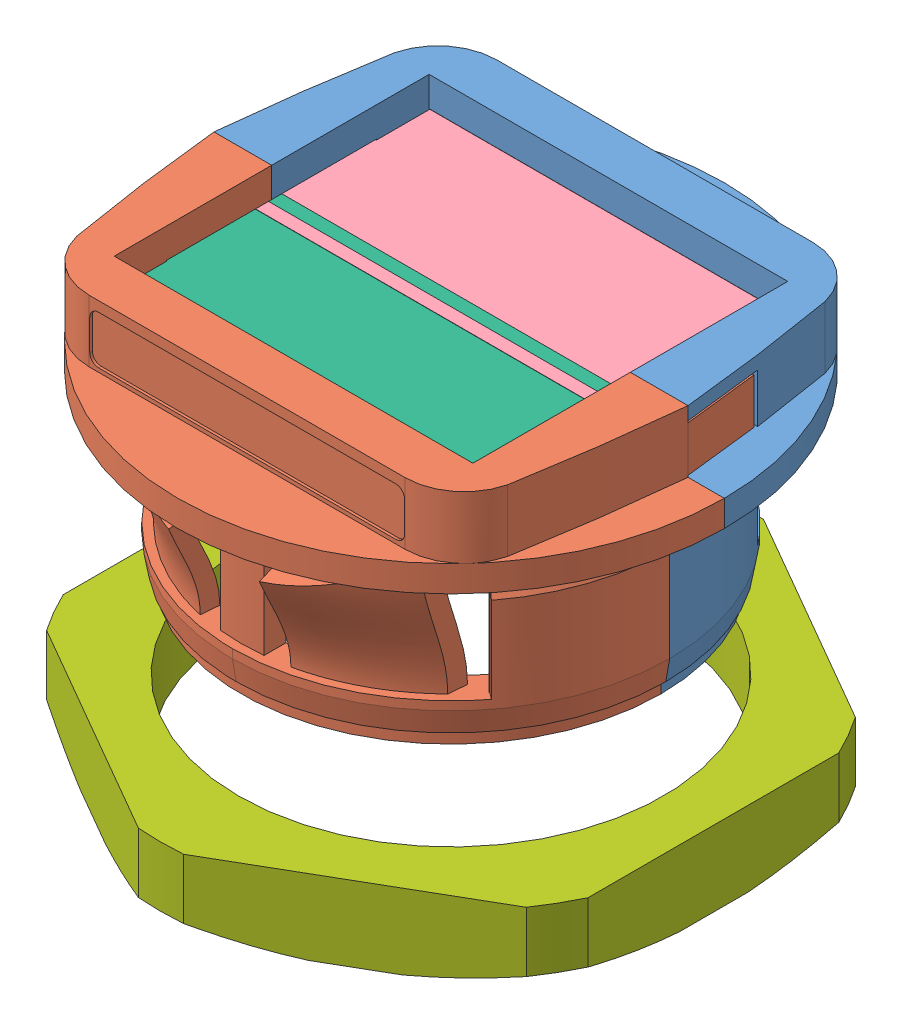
SolidWorks assembly 51540.SLDASM, configuration Default (file format 8000). Lengths in mm.
Overall size (65.97 48.71 66.5).
7 component instances, 7 part files, 0 mates.
Components (placement in the parent):
- 51540_01-1: 51540_01.SLDPRT [Default] at origin size (62.5 30.1 31.25)
- 51540_02-1: 51540_02.SLDPRT [Default] at origin size (62.5 30.1 39.75)
- 51540_03-1: 51540_03.SLDPRT [Default] at origin size (42 3.21 3)
- 51540_04-1: 51540_04.SLDPRT [Default] at origin size (42 2.61 22.7)
- 51540_05-1: 51540_05.SLDPRT [Default] at origin size (42 3.21 3)
- 51540_06-1: 51540_06.SLDPRT [Default] at origin size (42 2.61 22.7)
- 51540_07-1: 51540_07.SLDPRT [Default] at origin size (65.97 8.61 66.5)
